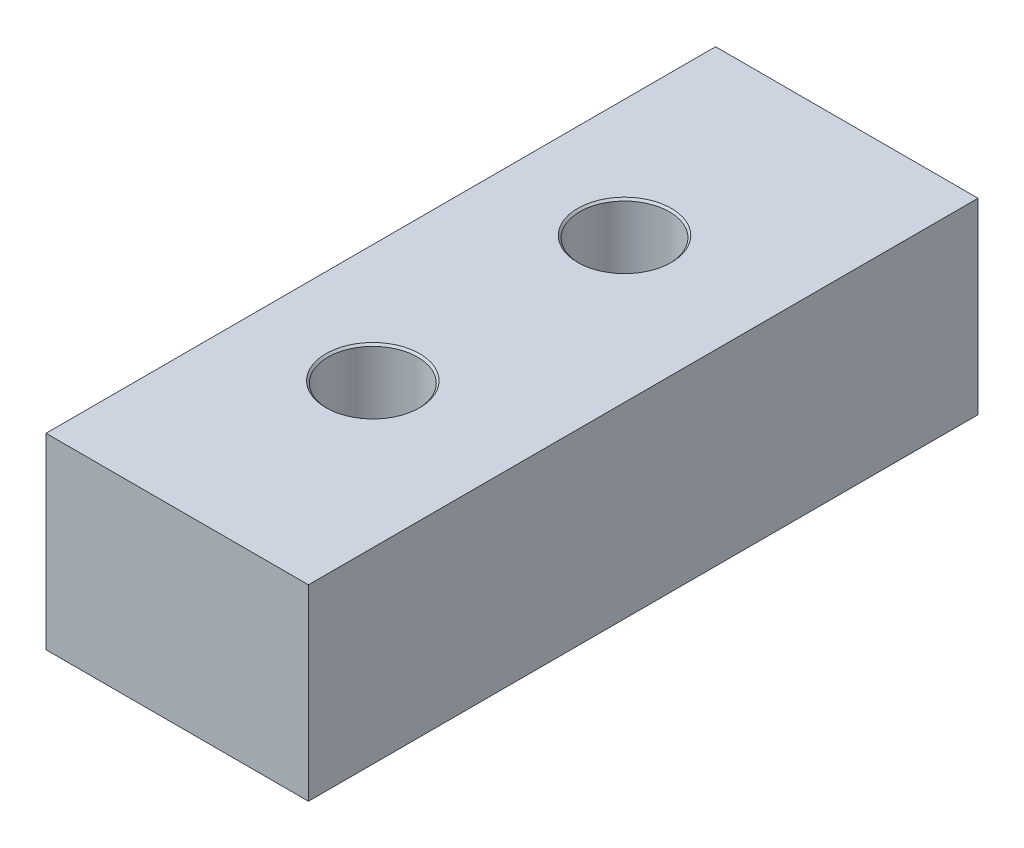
ISO-10303-21;
HEADER;
FILE_DESCRIPTION(('STEP AP214'),'2;1');
FILE_NAME('part.step','',(''),(''),'','','');
FILE_SCHEMA(('AUTOMOTIVE_DESIGN { 1 0 10303 214 1 1 1 1 }'));
ENDSEC;
DATA;
#1=APPLICATION_CONTEXT('core data for automotive mechanical design processes');
#2=APPLICATION_PROTOCOL_DEFINITION('international standard','automotive_design',2000,#1);
#3=PRODUCT_CONTEXT('',#1,'mechanical');
#4=PRODUCT('Part','Part','',(#3));
#5=PRODUCT_RELATED_PRODUCT_CATEGORY('part','',(#4));
#6=PRODUCT_DEFINITION_FORMATION('','',#4);
#7=PRODUCT_DEFINITION_CONTEXT('part definition',#1,'design');
#8=PRODUCT_DEFINITION('design','',#6,#7);
#9=PRODUCT_DEFINITION_SHAPE('','',#8);
#10=(LENGTH_UNIT() NAMED_UNIT(*) SI_UNIT(.MILLI.,.METRE.));
#11=(NAMED_UNIT(*) PLANE_ANGLE_UNIT() SI_UNIT($,.RADIAN.));
#12=(NAMED_UNIT(*) SI_UNIT($,.STERADIAN.) SOLID_ANGLE_UNIT());
#13=UNCERTAINTY_MEASURE_WITH_UNIT(LENGTH_MEASURE(1.E-05),#10,'distance_accuracy_value','');
#14=(GEOMETRIC_REPRESENTATION_CONTEXT(3) GLOBAL_UNCERTAINTY_ASSIGNED_CONTEXT((#13)) GLOBAL_UNIT_ASSIGNED_CONTEXT((#10,
#11,#12)) REPRESENTATION_CONTEXT('',''));
#15=CARTESIAN_POINT('',(0.,0.,0.));
#16=DIRECTION('',(0.,0.,1.));
#17=DIRECTION('',(1.,0.,0.));
#18=AXIS2_PLACEMENT_3D('',#15,#16,#17);
#19=CARTESIAN_POINT('',(24.5,17.5,62.5));
#20=DIRECTION('',(-1.,0.,0.));
#21=DIRECTION('',(0.,0.,1.));
#22=AXIS2_PLACEMENT_3D('',#19,#20,#21);
#23=PLANE('',#22);
#24=DIRECTION('',(0.,0.,-1.));
#25=VECTOR('',#24,1.);
#26=CARTESIAN_POINT('',(24.5,-17.5,62.5));
#27=LINE('',#26,#25);
#28=CARTESIAN_POINT('',(24.5,-17.5,62.5));
#29=VERTEX_POINT('',#28);
#30=CARTESIAN_POINT('',(24.5,-17.5,-62.5));
#31=VERTEX_POINT('',#30);
#32=EDGE_CURVE('E100',#29,#31,#27,.T.);
#33=ORIENTED_EDGE('',*,*,#32,.T.);
#34=DIRECTION('',(0.,-1.,0.));
#35=VECTOR('',#34,1.);
#36=CARTESIAN_POINT('',(24.5,17.5,-62.5));
#37=LINE('',#36,#35);
#38=CARTESIAN_POINT('',(24.5,17.5,-62.5));
#39=VERTEX_POINT('',#38);
#40=EDGE_CURVE('E11',#39,#31,#37,.T.);
#41=ORIENTED_EDGE('',*,*,#40,.F.);
#42=DIRECTION('',(0.,0.,-1.));
#43=VECTOR('',#42,1.);
#44=CARTESIAN_POINT('',(24.5,17.5,62.5));
#45=LINE('',#44,#43);
#46=CARTESIAN_POINT('',(24.5,17.5,62.5));
#47=VERTEX_POINT('',#46);
#48=EDGE_CURVE('E88',#47,#39,#45,.T.);
#49=ORIENTED_EDGE('',*,*,#48,.F.);
#50=DIRECTION('',(0.,-1.,0.));
#51=VECTOR('',#50,1.);
#52=CARTESIAN_POINT('',(24.5,17.5,62.5));
#53=LINE('',#52,#51);
#54=EDGE_CURVE('E96',#47,#29,#53,.T.);
#55=ORIENTED_EDGE('',*,*,#54,.T.);
#56=EDGE_LOOP('',(#33,#41,#49,#55));
#57=FACE_BOUND('',#56,.T.);
#58=ADVANCED_FACE('F37',(#57),#23,.F.);
#59=CARTESIAN_POINT('',(-24.5,17.5,-62.5));
#60=DIRECTION('',(0.,0.,1.));
#61=DIRECTION('',(1.,0.,0.));
#62=AXIS2_PLACEMENT_3D('',#59,#60,#61);
#63=PLANE('',#62);
#64=DIRECTION('',(-1.,0.,0.));
#65=VECTOR('',#64,1.);
#66=CARTESIAN_POINT('',(-24.5,-17.5,-62.5));
#67=LINE('',#66,#65);
#68=CARTESIAN_POINT('',(-24.5,-17.5,-62.5));
#69=VERTEX_POINT('',#68);
#70=EDGE_CURVE('E92',#31,#69,#67,.T.);
#71=ORIENTED_EDGE('',*,*,#70,.T.);
#72=DIRECTION('',(0.,-1.,0.));
#73=VECTOR('',#72,1.);
#74=CARTESIAN_POINT('',(-24.5,17.5,-62.5));
#75=LINE('',#74,#73);
#76=CARTESIAN_POINT('',(-24.5,17.5,-62.5));
#77=VERTEX_POINT('',#76);
#78=EDGE_CURVE('E45',#77,#69,#75,.T.);
#79=ORIENTED_EDGE('',*,*,#78,.F.);
#80=DIRECTION('',(-1.,0.,0.));
#81=VECTOR('',#80,1.);
#82=CARTESIAN_POINT('',(-24.5,17.5,-62.5));
#83=LINE('',#82,#81);
#84=EDGE_CURVE('E83',#39,#77,#83,.T.);
#85=ORIENTED_EDGE('',*,*,#84,.F.);
#86=ORIENTED_EDGE('',*,*,#40,.T.);
#87=EDGE_LOOP('',(#71,#79,#85,#86));
#88=FACE_BOUND('',#87,.T.);
#89=ADVANCED_FACE('F91',(#88),#63,.F.);
#90=CARTESIAN_POINT('',(-24.5,17.5,62.5));
#91=DIRECTION('',(1.,0.,0.));
#92=DIRECTION('',(0.,0.,-1.));
#93=AXIS2_PLACEMENT_3D('',#90,#91,#92);
#94=PLANE('',#93);
#95=DIRECTION('',(0.,0.,1.));
#96=VECTOR('',#95,1.);
#97=CARTESIAN_POINT('',(-24.5,-17.5,62.5));
#98=LINE('',#97,#96);
#99=CARTESIAN_POINT('',(-24.5,-17.5,62.5));
#100=VERTEX_POINT('',#99);
#101=EDGE_CURVE('E70',#69,#100,#98,.T.);
#102=ORIENTED_EDGE('',*,*,#101,.T.);
#103=DIRECTION('',(0.,-1.,0.));
#104=VECTOR('',#103,1.);
#105=CARTESIAN_POINT('',(-24.5,17.5,62.5));
#106=LINE('',#105,#104);
#107=CARTESIAN_POINT('',(-24.5,17.5,62.5));
#108=VERTEX_POINT('',#107);
#109=EDGE_CURVE('E93',#108,#100,#106,.T.);
#110=ORIENTED_EDGE('',*,*,#109,.F.);
#111=DIRECTION('',(0.,0.,1.));
#112=VECTOR('',#111,1.);
#113=CARTESIAN_POINT('',(-24.5,17.5,62.5));
#114=LINE('',#113,#112);
#115=EDGE_CURVE('E86',#77,#108,#114,.T.);
#116=ORIENTED_EDGE('',*,*,#115,.F.);
#117=ORIENTED_EDGE('',*,*,#78,.T.);
#118=EDGE_LOOP('',(#102,#110,#116,#117));
#119=FACE_BOUND('',#118,.T.);
#120=ADVANCED_FACE('F94',(#119),#94,.F.);
#121=CARTESIAN_POINT('',(-24.5,17.5,62.5));
#122=DIRECTION('',(0.,0.,-1.));
#123=DIRECTION('',(-1.,0.,0.));
#124=AXIS2_PLACEMENT_3D('',#121,#122,#123);
#125=PLANE('',#124);
#126=DIRECTION('',(1.,0.,0.));
#127=VECTOR('',#126,1.);
#128=CARTESIAN_POINT('',(-24.5,-17.5,62.5));
#129=LINE('',#128,#127);
#130=EDGE_CURVE('E76',#100,#29,#129,.T.);
#131=ORIENTED_EDGE('',*,*,#130,.T.);
#132=ORIENTED_EDGE('',*,*,#54,.F.);
#133=DIRECTION('',(1.,0.,0.));
#134=VECTOR('',#133,1.);
#135=CARTESIAN_POINT('',(-24.5,17.5,62.5));
#136=LINE('',#135,#134);
#137=EDGE_CURVE('E53',#108,#47,#136,.T.);
#138=ORIENTED_EDGE('',*,*,#137,.F.);
#139=ORIENTED_EDGE('',*,*,#109,.T.);
#140=EDGE_LOOP('',(#131,#132,#138,#139));
#141=FACE_BOUND('',#140,.T.);
#142=ADVANCED_FACE('F108',(#141),#125,.F.);
#143=CARTESIAN_POINT('',(0.,17.5,0.));
#144=DIRECTION('',(0.,-1.,0.));
#145=DIRECTION('',(0.,0.,-1.));
#146=AXIS2_PLACEMENT_3D('',#143,#144,#145);
#147=PLANE('',#146);
#148=CARTESIAN_POINT('',(-2.48749999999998,17.5,-23.495));
#149=DIRECTION('',(0.,1.,0.));
#150=DIRECTION('',(0.,0.,1.));
#151=AXIS2_PLACEMENT_3D('',#148,#149,#150);
#152=CIRCLE('',#151,8.75);
#153=CARTESIAN_POINT('',(-2.48749999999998,17.5,-14.745));
#154=VERTEX_POINT('',#153);
#155=EDGE_CURVE('E167',#154,#154,#152,.T.);
#156=ORIENTED_EDGE('',*,*,#155,.F.);
#157=EDGE_LOOP('',(#156));
#158=FACE_BOUND('',#157,.T.);
#159=CARTESIAN_POINT('',(-2.48749999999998,17.5,23.495));
#160=DIRECTION('',(0.,1.,0.));
#161=DIRECTION('',(0.,0.,1.));
#162=AXIS2_PLACEMENT_3D('',#159,#160,#161);
#163=CIRCLE('',#162,8.75);
#164=CARTESIAN_POINT('',(-2.48749999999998,17.5,32.245));
#165=VERTEX_POINT('',#164);
#166=EDGE_CURVE('E146',#165,#165,#163,.T.);
#167=ORIENTED_EDGE('',*,*,#166,.F.);
#168=EDGE_LOOP('',(#167));
#169=FACE_BOUND('',#168,.T.);
#170=ORIENTED_EDGE('',*,*,#48,.T.);
#171=ORIENTED_EDGE('',*,*,#84,.T.);
#172=ORIENTED_EDGE('',*,*,#115,.T.);
#173=ORIENTED_EDGE('',*,*,#137,.T.);
#174=EDGE_LOOP('',(#170,#171,#172,#173));
#175=FACE_BOUND('',#174,.T.);
#176=ADVANCED_FACE('F84',(#158,#169,#175),#147,.F.);
#177=CARTESIAN_POINT('',(0.,-17.5,0.));
#178=DIRECTION('',(0.,-1.,0.));
#179=DIRECTION('',(0.,0.,-1.));
#180=AXIS2_PLACEMENT_3D('',#177,#178,#179);
#181=PLANE('',#180);
#182=CARTESIAN_POINT('',(-2.48749999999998,-17.5,-23.495));
#183=DIRECTION('',(0.,1.,0.));
#184=DIRECTION('',(0.,0.,1.));
#185=AXIS2_PLACEMENT_3D('',#182,#183,#184);
#186=CIRCLE('',#185,5.74999999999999);
#187=CARTESIAN_POINT('',(-2.48749999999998,-17.5,-17.745));
#188=VERTEX_POINT('',#187);
#189=EDGE_CURVE('E170',#188,#188,#186,.T.);
#190=ORIENTED_EDGE('',*,*,#189,.T.);
#191=EDGE_LOOP('',(#190));
#192=FACE_BOUND('',#191,.T.);
#193=CARTESIAN_POINT('',(-2.48749999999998,-17.5,23.495));
#194=DIRECTION('',(0.,1.,0.));
#195=DIRECTION('',(0.,0.,1.));
#196=AXIS2_PLACEMENT_3D('',#193,#194,#195);
#197=CIRCLE('',#196,5.74999999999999);
#198=CARTESIAN_POINT('',(-2.48749999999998,-17.5,29.245));
#199=VERTEX_POINT('',#198);
#200=EDGE_CURVE('E149',#199,#199,#197,.T.);
#201=ORIENTED_EDGE('',*,*,#200,.T.);
#202=EDGE_LOOP('',(#201));
#203=FACE_BOUND('',#202,.T.);
#204=CARTESIAN_POINT('',(-14.187499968,-17.5,-23.5));
#205=DIRECTION('',(0.,-1.,0.));
#206=DIRECTION('',(0.,0.,-1.));
#207=AXIS2_PLACEMENT_3D('',#204,#205,#206);
#208=CIRCLE('',#207,4.5);
#209=CARTESIAN_POINT('',(-14.187499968,-17.5,-28.));
#210=VERTEX_POINT('',#209);
#211=EDGE_CURVE('E128',#210,#210,#208,.T.);
#212=ORIENTED_EDGE('',*,*,#211,.F.);
#213=EDGE_LOOP('',(#212));
#214=FACE_BOUND('',#213,.T.);
#215=CARTESIAN_POINT('',(9.21249996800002,-17.5,23.5));
#216=DIRECTION('',(0.,-1.,0.));
#217=DIRECTION('',(0.,0.,-1.));
#218=AXIS2_PLACEMENT_3D('',#215,#216,#217);
#219=CIRCLE('',#218,4.5);
#220=CARTESIAN_POINT('',(9.21249996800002,-17.5,19.));
#221=VERTEX_POINT('',#220);
#222=EDGE_CURVE('E119',#221,#221,#219,.T.);
#223=ORIENTED_EDGE('',*,*,#222,.F.);
#224=EDGE_LOOP('',(#223));
#225=FACE_BOUND('',#224,.T.);
#226=ORIENTED_EDGE('',*,*,#32,.F.);
#227=ORIENTED_EDGE('',*,*,#130,.F.);
#228=ORIENTED_EDGE('',*,*,#101,.F.);
#229=ORIENTED_EDGE('',*,*,#70,.F.);
#230=EDGE_LOOP('',(#226,#227,#228,#229));
#231=FACE_BOUND('',#230,.T.);
#232=ADVANCED_FACE('F111',(#192,#203,#214,#225,#231),#181,.T.);
#233=CARTESIAN_POINT('',(9.21249996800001,-10.642,23.5));
#234=DIRECTION('',(0.,1.,0.));
#235=DIRECTION('',(0.,0.,1.));
#236=AXIS2_PLACEMENT_3D('',#233,#234,#235);
#237=PLANE('',#236);
#238=CARTESIAN_POINT('',(9.21249996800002,-10.642,23.5));
#239=DIRECTION('',(0.,-1.,0.));
#240=DIRECTION('',(0.,0.,-1.));
#241=AXIS2_PLACEMENT_3D('',#238,#239,#240);
#242=CIRCLE('',#241,4.00938999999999);
#243=CARTESIAN_POINT('',(9.21249996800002,-10.642,19.49061));
#244=VERTEX_POINT('',#243);
#245=EDGE_CURVE('E103',#244,#244,#242,.T.);
#246=ORIENTED_EDGE('',*,*,#245,.T.);
#247=EDGE_LOOP('',(#246));
#248=FACE_BOUND('',#247,.T.);
#249=ADVANCED_FACE('F241',(#248),#237,.F.);
#250=CARTESIAN_POINT('',(9.21249996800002,-17.5,23.5));
#251=DIRECTION('',(0.,-1.,0.));
#252=DIRECTION('',(0.,0.,-1.));
#253=AXIS2_PLACEMENT_3D('',#250,#251,#252);
#254=CYLINDRICAL_SURFACE('',#253,4.00938999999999);
#255=ORIENTED_EDGE('',*,*,#245,.F.);
#256=EDGE_LOOP('',(#255));
#257=FACE_BOUND('',#256,.T.);
#258=CARTESIAN_POINT('',(9.21249996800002,-17.00939,23.5));
#259=DIRECTION('',(0.,-1.,0.));
#260=DIRECTION('',(0.,0.,-1.));
#261=AXIS2_PLACEMENT_3D('',#258,#259,#260);
#262=CIRCLE('',#261,4.00939);
#263=CARTESIAN_POINT('',(9.21249996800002,-17.00939,19.49061));
#264=VERTEX_POINT('',#263);
#265=EDGE_CURVE('E116',#264,#264,#262,.T.);
#266=ORIENTED_EDGE('',*,*,#265,.T.);
#267=EDGE_LOOP('',(#266));
#268=FACE_BOUND('',#267,.T.);
#269=ADVANCED_FACE('F245',(#257,#268),#254,.F.);
#270=CARTESIAN_POINT('',(9.21249996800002,-17.5,23.5));
#271=DIRECTION('',(0.,-1.,0.));
#272=DIRECTION('',(0.,0.,-1.));
#273=AXIS2_PLACEMENT_3D('',#270,#271,#272);
#274=CONICAL_SURFACE('',#273,4.5,0.785398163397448);
#275=ORIENTED_EDGE('',*,*,#265,.F.);
#276=EDGE_LOOP('',(#275));
#277=FACE_BOUND('',#276,.T.);
#278=ORIENTED_EDGE('',*,*,#222,.T.);
#279=EDGE_LOOP('',(#278));
#280=FACE_BOUND('',#279,.T.);
#281=ADVANCED_FACE('F249',(#277,#280),#274,.F.);
#282=CARTESIAN_POINT('',(-14.187499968,-10.642,-23.5));
#283=DIRECTION('',(0.,1.,0.));
#284=DIRECTION('',(0.,0.,1.));
#285=AXIS2_PLACEMENT_3D('',#282,#283,#284);
#286=PLANE('',#285);
#287=CARTESIAN_POINT('',(-14.187499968,-10.642,-23.5));
#288=DIRECTION('',(0.,-1.,0.));
#289=DIRECTION('',(0.,0.,-1.));
#290=AXIS2_PLACEMENT_3D('',#287,#288,#289);
#291=CIRCLE('',#290,4.00938999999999);
#292=CARTESIAN_POINT('',(-14.187499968,-10.642,-27.50939));
#293=VERTEX_POINT('',#292);
#294=EDGE_CURVE('E122',#293,#293,#291,.T.);
#295=ORIENTED_EDGE('',*,*,#294,.T.);
#296=EDGE_LOOP('',(#295));
#297=FACE_BOUND('',#296,.T.);
#298=ADVANCED_FACE('F253',(#297),#286,.F.);
#299=CARTESIAN_POINT('',(-14.187499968,-17.5,-23.5));
#300=DIRECTION('',(0.,-1.,0.));
#301=DIRECTION('',(0.,0.,-1.));
#302=AXIS2_PLACEMENT_3D('',#299,#300,#301);
#303=CYLINDRICAL_SURFACE('',#302,4.00938999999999);
#304=ORIENTED_EDGE('',*,*,#294,.F.);
#305=EDGE_LOOP('',(#304));
#306=FACE_BOUND('',#305,.T.);
#307=CARTESIAN_POINT('',(-14.187499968,-17.00939,-23.5));
#308=DIRECTION('',(0.,-1.,0.));
#309=DIRECTION('',(0.,0.,-1.));
#310=AXIS2_PLACEMENT_3D('',#307,#308,#309);
#311=CIRCLE('',#310,4.00939);
#312=CARTESIAN_POINT('',(-14.187499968,-17.00939,-27.50939));
#313=VERTEX_POINT('',#312);
#314=EDGE_CURVE('E125',#313,#313,#311,.T.);
#315=ORIENTED_EDGE('',*,*,#314,.T.);
#316=EDGE_LOOP('',(#315));
#317=FACE_BOUND('',#316,.T.);
#318=ADVANCED_FACE('F257',(#306,#317),#303,.F.);
#319=CARTESIAN_POINT('',(-14.187499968,-17.5,-23.5));
#320=DIRECTION('',(0.,-1.,0.));
#321=DIRECTION('',(0.,0.,-1.));
#322=AXIS2_PLACEMENT_3D('',#319,#320,#321);
#323=CONICAL_SURFACE('',#322,4.5,0.785398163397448);
#324=ORIENTED_EDGE('',*,*,#314,.F.);
#325=EDGE_LOOP('',(#324));
#326=FACE_BOUND('',#325,.T.);
#327=ORIENTED_EDGE('',*,*,#211,.T.);
#328=EDGE_LOOP('',(#327));
#329=FACE_BOUND('',#328,.T.);
#330=ADVANCED_FACE('F261',(#326,#329),#323,.F.);
#331=CARTESIAN_POINT('',(-2.48749999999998,-17.1094,23.495));
#332=DIRECTION('',(0.,-1.,0.));
#333=DIRECTION('',(0.,0.,-1.));
#334=AXIS2_PLACEMENT_3D('',#331,#332,#333);
#335=CONICAL_SURFACE('',#334,5.35939999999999,0.785398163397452);
#336=ORIENTED_EDGE('',*,*,#200,.F.);
#337=EDGE_LOOP('',(#336));
#338=FACE_BOUND('',#337,.T.);
#339=CARTESIAN_POINT('',(-2.48749999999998,-17.1094,23.495));
#340=DIRECTION('',(0.,1.,0.));
#341=DIRECTION('',(0.,0.,1.));
#342=AXIS2_PLACEMENT_3D('',#339,#340,#341);
#343=CIRCLE('',#342,5.35939999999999);
#344=CARTESIAN_POINT('',(-2.48749999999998,-17.1094,28.8544));
#345=VERTEX_POINT('',#344);
#346=EDGE_CURVE('E131',#345,#345,#343,.T.);
#347=ORIENTED_EDGE('',*,*,#346,.T.);
#348=EDGE_LOOP('',(#347));
#349=FACE_BOUND('',#348,.T.);
#350=ADVANCED_FACE('F265',(#338,#349),#335,.F.);
#351=CARTESIAN_POINT('',(-2.48749999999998,17.5,23.495));
#352=DIRECTION('',(0.,1.,0.));
#353=DIRECTION('',(0.,0.,1.));
#354=AXIS2_PLACEMENT_3D('',#351,#352,#353);
#355=CYLINDRICAL_SURFACE('',#354,5.3594);
#356=ORIENTED_EDGE('',*,*,#346,.F.);
#357=EDGE_LOOP('',(#356));
#358=FACE_BOUND('',#357,.T.);
#359=CARTESIAN_POINT('',(-2.48749999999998,-9.05259999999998,23.495));
#360=DIRECTION('',(0.,1.,0.));
#361=DIRECTION('',(0.,0.,1.));
#362=AXIS2_PLACEMENT_3D('',#359,#360,#361);
#363=CIRCLE('',#362,5.3594);
#364=CARTESIAN_POINT('',(-2.48749999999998,-9.05259999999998,28.8544));
#365=VERTEX_POINT('',#364);
#366=EDGE_CURVE('E134',#365,#365,#363,.T.);
#367=ORIENTED_EDGE('',*,*,#366,.T.);
#368=EDGE_LOOP('',(#367));
#369=FACE_BOUND('',#368,.T.);
#370=ADVANCED_FACE('F269',(#358,#369),#355,.F.);
#371=CARTESIAN_POINT('',(-2.48749999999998,-8.662,23.495));
#372=DIRECTION('',(0.,1.,0.));
#373=DIRECTION('',(0.,0.,1.));
#374=AXIS2_PLACEMENT_3D('',#371,#372,#373);
#375=CONICAL_SURFACE('',#374,5.74999999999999,0.785398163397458);
#376=ORIENTED_EDGE('',*,*,#366,.F.);
#377=EDGE_LOOP('',(#376));
#378=FACE_BOUND('',#377,.T.);
#379=CARTESIAN_POINT('',(-2.48749999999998,-8.662,23.495));
#380=DIRECTION('',(0.,1.,0.));
#381=DIRECTION('',(0.,0.,1.));
#382=AXIS2_PLACEMENT_3D('',#379,#380,#381);
#383=CIRCLE('',#382,5.74999999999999);
#384=CARTESIAN_POINT('',(-2.48749999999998,-8.662,29.245));
#385=VERTEX_POINT('',#384);
#386=EDGE_CURVE('E137',#385,#385,#383,.T.);
#387=ORIENTED_EDGE('',*,*,#386,.T.);
#388=EDGE_LOOP('',(#387));
#389=FACE_BOUND('',#388,.T.);
#390=ADVANCED_FACE('F273',(#378,#389),#375,.F.);
#391=CARTESIAN_POINT('',(3.26250000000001,-8.662,23.495));
#392=DIRECTION('',(0.,-1.,0.));
#393=DIRECTION('',(0.,0.,-1.));
#394=AXIS2_PLACEMENT_3D('',#391,#392,#393);
#395=PLANE('',#394);
#396=ORIENTED_EDGE('',*,*,#386,.F.);
#397=EDGE_LOOP('',(#396));
#398=FACE_BOUND('',#397,.T.);
#399=CARTESIAN_POINT('',(-2.48749999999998,-8.662,23.495));
#400=DIRECTION('',(0.,1.,0.));
#401=DIRECTION('',(0.,0.,1.));
#402=AXIS2_PLACEMENT_3D('',#399,#400,#401);
#403=CIRCLE('',#402,8.38199999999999);
#404=CARTESIAN_POINT('',(-2.48749999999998,-8.662,31.877));
#405=VERTEX_POINT('',#404);
#406=EDGE_CURVE('E140',#405,#405,#403,.T.);
#407=ORIENTED_EDGE('',*,*,#406,.T.);
#408=EDGE_LOOP('',(#407));
#409=FACE_BOUND('',#408,.T.);
#410=ADVANCED_FACE('F225',(#398,#409),#395,.F.);
#411=CARTESIAN_POINT('',(-2.48749999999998,17.5,23.495));
#412=DIRECTION('',(0.,1.,0.));
#413=DIRECTION('',(0.,0.,1.));
#414=AXIS2_PLACEMENT_3D('',#411,#412,#413);
#415=CYLINDRICAL_SURFACE('',#414,8.382);
#416=ORIENTED_EDGE('',*,*,#406,.F.);
#417=EDGE_LOOP('',(#416));
#418=FACE_BOUND('',#417,.T.);
#419=CARTESIAN_POINT('',(-2.48749999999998,17.132,23.495));
#420=DIRECTION('',(0.,1.,0.));
#421=DIRECTION('',(0.,0.,1.));
#422=AXIS2_PLACEMENT_3D('',#419,#420,#421);
#423=CIRCLE('',#422,8.382);
#424=CARTESIAN_POINT('',(-2.48749999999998,17.132,31.877));
#425=VERTEX_POINT('',#424);
#426=EDGE_CURVE('E143',#425,#425,#423,.T.);
#427=ORIENTED_EDGE('',*,*,#426,.T.);
#428=EDGE_LOOP('',(#427));
#429=FACE_BOUND('',#428,.T.);
#430=ADVANCED_FACE('F219',(#418,#429),#415,.F.);
#431=CARTESIAN_POINT('',(-2.48749999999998,17.5,23.495));
#432=DIRECTION('',(0.,1.,0.));
#433=DIRECTION('',(0.,0.,1.));
#434=AXIS2_PLACEMENT_3D('',#431,#432,#433);
#435=CONICAL_SURFACE('',#434,8.75,0.785398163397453);
#436=ORIENTED_EDGE('',*,*,#426,.F.);
#437=EDGE_LOOP('',(#436));
#438=FACE_BOUND('',#437,.T.);
#439=ORIENTED_EDGE('',*,*,#166,.T.);
#440=EDGE_LOOP('',(#439));
#441=FACE_BOUND('',#440,.T.);
#442=ADVANCED_FACE('F180',(#438,#441),#435,.F.);
#443=CARTESIAN_POINT('',(-2.48749999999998,-17.1094,-23.495));
#444=DIRECTION('',(0.,-1.,0.));
#445=DIRECTION('',(0.,0.,-1.));
#446=AXIS2_PLACEMENT_3D('',#443,#444,#445);
#447=CONICAL_SURFACE('',#446,5.35939999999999,0.785398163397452);
#448=ORIENTED_EDGE('',*,*,#189,.F.);
#449=EDGE_LOOP('',(#448));
#450=FACE_BOUND('',#449,.T.);
#451=CARTESIAN_POINT('',(-2.48749999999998,-17.1094,-23.495));
#452=DIRECTION('',(0.,1.,0.));
#453=DIRECTION('',(0.,0.,1.));
#454=AXIS2_PLACEMENT_3D('',#451,#452,#453);
#455=CIRCLE('',#454,5.35939999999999);
#456=CARTESIAN_POINT('',(-2.48749999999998,-17.1094,-18.1356));
#457=VERTEX_POINT('',#456);
#458=EDGE_CURVE('E152',#457,#457,#455,.T.);
#459=ORIENTED_EDGE('',*,*,#458,.T.);
#460=EDGE_LOOP('',(#459));
#461=FACE_BOUND('',#460,.T.);
#462=ADVANCED_FACE('F176',(#450,#461),#447,.F.);
#463=CARTESIAN_POINT('',(-2.48749999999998,17.5,-23.495));
#464=DIRECTION('',(0.,1.,0.));
#465=DIRECTION('',(0.,0.,1.));
#466=AXIS2_PLACEMENT_3D('',#463,#464,#465);
#467=CYLINDRICAL_SURFACE('',#466,5.3594);
#468=ORIENTED_EDGE('',*,*,#458,.F.);
#469=EDGE_LOOP('',(#468));
#470=FACE_BOUND('',#469,.T.);
#471=CARTESIAN_POINT('',(-2.48749999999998,-9.05259999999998,-23.495));
#472=DIRECTION('',(0.,1.,0.));
#473=DIRECTION('',(0.,0.,1.));
#474=AXIS2_PLACEMENT_3D('',#471,#472,#473);
#475=CIRCLE('',#474,5.3594);
#476=CARTESIAN_POINT('',(-2.48749999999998,-9.05259999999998,-18.1356));
#477=VERTEX_POINT('',#476);
#478=EDGE_CURVE('E155',#477,#477,#475,.T.);
#479=ORIENTED_EDGE('',*,*,#478,.T.);
#480=EDGE_LOOP('',(#479));
#481=FACE_BOUND('',#480,.T.);
#482=ADVANCED_FACE('F179',(#470,#481),#467,.F.);
#483=CARTESIAN_POINT('',(-2.48749999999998,-8.662,-23.495));
#484=DIRECTION('',(0.,1.,0.));
#485=DIRECTION('',(0.,0.,1.));
#486=AXIS2_PLACEMENT_3D('',#483,#484,#485);
#487=CONICAL_SURFACE('',#486,5.74999999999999,0.785398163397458);
#488=ORIENTED_EDGE('',*,*,#478,.F.);
#489=EDGE_LOOP('',(#488));
#490=FACE_BOUND('',#489,.T.);
#491=CARTESIAN_POINT('',(-2.48749999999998,-8.662,-23.495));
#492=DIRECTION('',(0.,1.,0.));
#493=DIRECTION('',(0.,0.,1.));
#494=AXIS2_PLACEMENT_3D('',#491,#492,#493);
#495=CIRCLE('',#494,5.74999999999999);
#496=CARTESIAN_POINT('',(-2.48749999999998,-8.662,-17.745));
#497=VERTEX_POINT('',#496);
#498=EDGE_CURVE('E158',#497,#497,#495,.T.);
#499=ORIENTED_EDGE('',*,*,#498,.T.);
#500=EDGE_LOOP('',(#499));
#501=FACE_BOUND('',#500,.T.);
#502=ADVANCED_FACE('F186',(#490,#501),#487,.F.);
#503=CARTESIAN_POINT('',(3.26250000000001,-8.662,-23.495));
#504=DIRECTION('',(0.,-1.,0.));
#505=DIRECTION('',(0.,0.,-1.));
#506=AXIS2_PLACEMENT_3D('',#503,#504,#505);
#507=PLANE('',#506);
#508=ORIENTED_EDGE('',*,*,#498,.F.);
#509=EDGE_LOOP('',(#508));
#510=FACE_BOUND('',#509,.T.);
#511=CARTESIAN_POINT('',(-2.48749999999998,-8.662,-23.495));
#512=DIRECTION('',(0.,1.,0.));
#513=DIRECTION('',(0.,0.,1.));
#514=AXIS2_PLACEMENT_3D('',#511,#512,#513);
#515=CIRCLE('',#514,8.38199999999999);
#516=CARTESIAN_POINT('',(-2.48749999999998,-8.662,-15.113));
#517=VERTEX_POINT('',#516);
#518=EDGE_CURVE('E161',#517,#517,#515,.T.);
#519=ORIENTED_EDGE('',*,*,#518,.T.);
#520=EDGE_LOOP('',(#519));
#521=FACE_BOUND('',#520,.T.);
#522=ADVANCED_FACE('F192',(#510,#521),#507,.F.);
#523=CARTESIAN_POINT('',(-2.48749999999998,17.5,-23.495));
#524=DIRECTION('',(0.,1.,0.));
#525=DIRECTION('',(0.,0.,1.));
#526=AXIS2_PLACEMENT_3D('',#523,#524,#525);
#527=CYLINDRICAL_SURFACE('',#526,8.382);
#528=ORIENTED_EDGE('',*,*,#518,.F.);
#529=EDGE_LOOP('',(#528));
#530=FACE_BOUND('',#529,.T.);
#531=CARTESIAN_POINT('',(-2.48749999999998,17.132,-23.495));
#532=DIRECTION('',(0.,1.,0.));
#533=DIRECTION('',(0.,0.,1.));
#534=AXIS2_PLACEMENT_3D('',#531,#532,#533);
#535=CIRCLE('',#534,8.382);
#536=CARTESIAN_POINT('',(-2.48749999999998,17.132,-15.113));
#537=VERTEX_POINT('',#536);
#538=EDGE_CURVE('E164',#537,#537,#535,.T.);
#539=ORIENTED_EDGE('',*,*,#538,.T.);
#540=EDGE_LOOP('',(#539));
#541=FACE_BOUND('',#540,.T.);
#542=ADVANCED_FACE('F198',(#530,#541),#527,.F.);
#543=CARTESIAN_POINT('',(-2.48749999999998,17.5,-23.495));
#544=DIRECTION('',(0.,1.,0.));
#545=DIRECTION('',(0.,0.,1.));
#546=AXIS2_PLACEMENT_3D('',#543,#544,#545);
#547=CONICAL_SURFACE('',#546,8.75,0.785398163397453);
#548=ORIENTED_EDGE('',*,*,#538,.F.);
#549=EDGE_LOOP('',(#548));
#550=FACE_BOUND('',#549,.T.);
#551=ORIENTED_EDGE('',*,*,#155,.T.);
#552=EDGE_LOOP('',(#551));
#553=FACE_BOUND('',#552,.T.);
#554=ADVANCED_FACE('F204',(#550,#553),#547,.F.);
#555=CLOSED_SHELL('',(#58,#89,#120,#142,#176,#232,#249,#269,#281,#298,#318,#330,#350,#370,#390,
#410,#430,#442,#462,#482,#502,#522,#542,#554));
#556=MANIFOLD_SOLID_BREP('B2',#555);
#557=ADVANCED_BREP_SHAPE_REPRESENTATION('',(#18,#556),#14);
#558=SHAPE_DEFINITION_REPRESENTATION(#9,#557);
ENDSEC;
END-ISO-10303-21;
